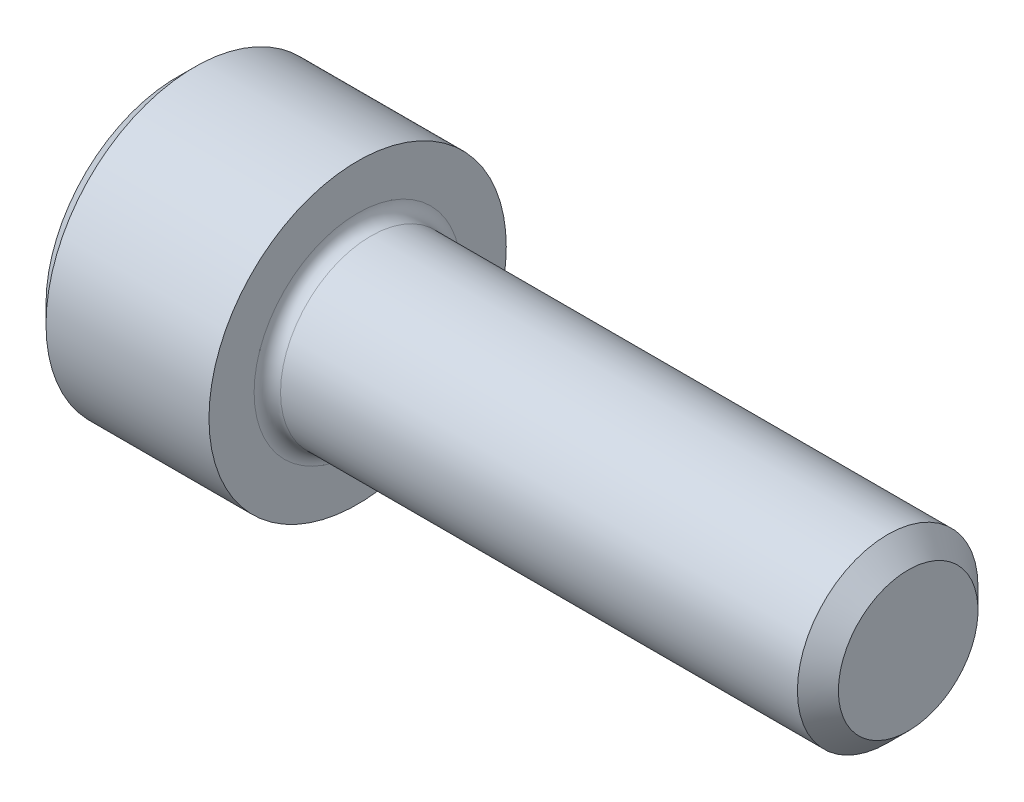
from build123d import *

# Parameters (mm, degrees)
FILLET1_R   = 0.3048
HEX_2_DEPTH = 1.9558


with BuildPart() as part:
    # BodySke → Base-Revolve (revolve)
    with BuildSketch(Plane.XY, mode=Mode.PRIVATE) as base_revolve_sk:
        Polygon((0, 0), (0, 3.0226), (0.4064, 3.429), (4.1656, 3.429), (4.1656, 2.0828), (16.39316, 2.0828), (16.8656, 1.61036), (16.8656, 0), align=None)
    revolve(base_revolve_sk.sketch.rotate(Axis((-31.75, 0, 0), (1, 0, 0)), 90), axis=Axis((-31.75, 0, 0), (1, 0, 0)))

    # Fillet1
    fillet1_edges = [part.edges().sort_by_distance(p)[0] for p in [
        (4.1656, 0, -2.0828),
    ]]
    fillet(fillet1_edges, radius=FILLET1_R)

    # Sketch2 → Hex-PreBroach (revolve, cut)
    with BuildSketch(Plane.XY, mode=Mode.PRIVATE) as hex_prebroach_sk:
        Polygon((0, 1.778), (1.9558, 1.778), (2.982328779, 0), (0, 0), align=None)
    revolve(hex_prebroach_sk.sketch.rotate(Axis((0, 0, 0), (1, 0, 0)), 90), axis=Axis((0, 0, 0), (1, 0, 0)), mode=Mode.SUBTRACT)

    # Sketch3 → Hex 2 (cut)
    with BuildSketch(Plane(origin=(0, 0, 0), x_dir=(0, 0.500000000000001, 0.866025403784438), z_dir=(-1, 0, 0))):
        Polygon((1.026528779, 1.778), (-1.026528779, 1.778), (-2.053057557, 0), (-1.026528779, -1.778), (1.026528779, -1.778), (2.053057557, 0), align=None)
    extrude(amount=-HEX_2_DEPTH, mode=Mode.SUBTRACT)


solid = part.part
